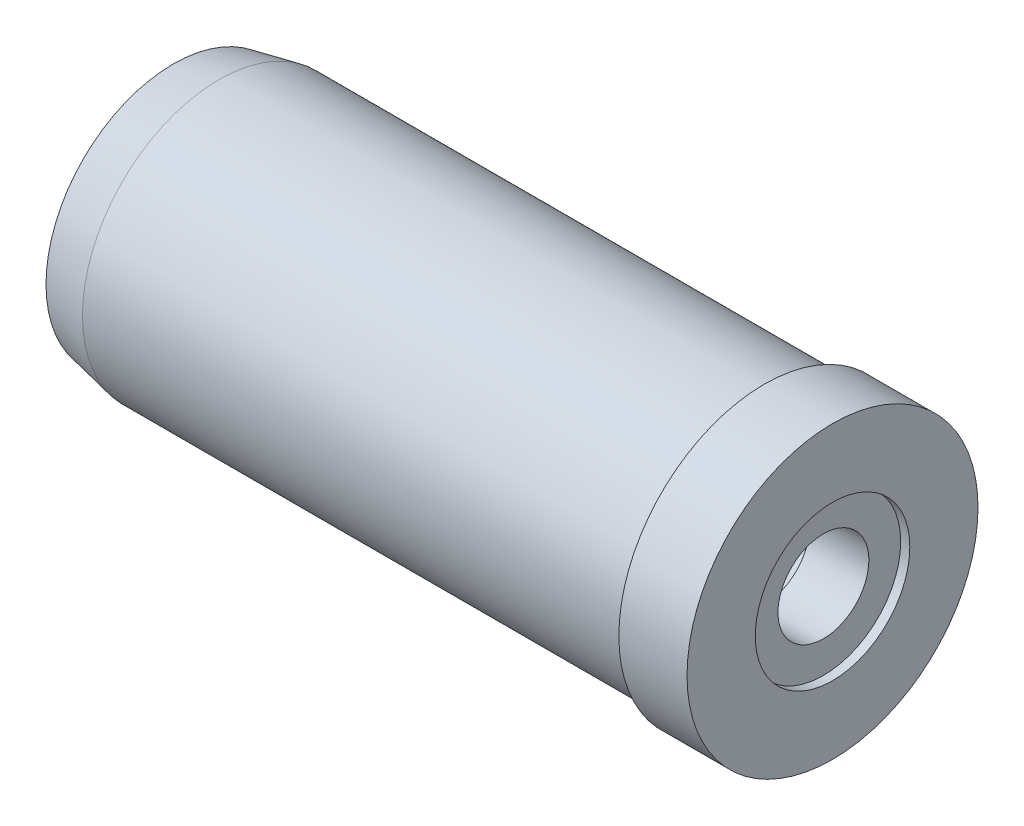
ISO-10303-21;
HEADER;
FILE_DESCRIPTION(('STEP AP214'),'2;1');
FILE_NAME('part.step','',(''),(''),'','','');
FILE_SCHEMA(('AUTOMOTIVE_DESIGN { 1 0 10303 214 1 1 1 1 }'));
ENDSEC;
DATA;
#1=APPLICATION_CONTEXT('core data for automotive mechanical design processes');
#2=APPLICATION_PROTOCOL_DEFINITION('international standard','automotive_design',2000,#1);
#3=PRODUCT_CONTEXT('',#1,'mechanical');
#4=PRODUCT('Part','Part','',(#3));
#5=PRODUCT_RELATED_PRODUCT_CATEGORY('part','',(#4));
#6=PRODUCT_DEFINITION_FORMATION('','',#4);
#7=PRODUCT_DEFINITION_CONTEXT('part definition',#1,'design');
#8=PRODUCT_DEFINITION('design','',#6,#7);
#9=PRODUCT_DEFINITION_SHAPE('','',#8);
#10=(LENGTH_UNIT() NAMED_UNIT(*) SI_UNIT(.MILLI.,.METRE.));
#11=(NAMED_UNIT(*) PLANE_ANGLE_UNIT() SI_UNIT($,.RADIAN.));
#12=(NAMED_UNIT(*) SI_UNIT($,.STERADIAN.) SOLID_ANGLE_UNIT());
#13=UNCERTAINTY_MEASURE_WITH_UNIT(LENGTH_MEASURE(1.E-05),#10,'distance_accuracy_value','');
#14=(GEOMETRIC_REPRESENTATION_CONTEXT(3) GLOBAL_UNCERTAINTY_ASSIGNED_CONTEXT((#13)) GLOBAL_UNIT_ASSIGNED_CONTEXT((#10,
#11,#12)) REPRESENTATION_CONTEXT('',''));
#15=CARTESIAN_POINT('',(0.,0.,0.));
#16=DIRECTION('',(0.,0.,1.));
#17=DIRECTION('',(1.,0.,0.));
#18=AXIS2_PLACEMENT_3D('',#15,#16,#17);
#19=CARTESIAN_POINT('',(32.5497741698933,0.,0.));
#20=DIRECTION('',(1.,0.,0.));
#21=DIRECTION('',(0.,0.,-1.));
#22=AXIS2_PLACEMENT_3D('',#19,#20,#21);
#23=CYLINDRICAL_SURFACE('',#22,10.);
#24=CARTESIAN_POINT('',(175.54977417,0.,0.));
#25=DIRECTION('',(1.,0.,0.));
#26=DIRECTION('',(0.,0.,-1.));
#27=AXIS2_PLACEMENT_3D('',#24,#25,#26);
#28=CIRCLE('',#27,10.);
#29=CARTESIAN_POINT('',(175.54977417,0.,-10.));
#30=VERTEX_POINT('',#29);
#31=EDGE_CURVE('E10',#30,#30,#28,.T.);
#32=ORIENTED_EDGE('',*,*,#31,.T.);
#33=EDGE_LOOP('',(#32));
#34=FACE_BOUND('',#33,.T.);
#35=CARTESIAN_POINT('',(162.54977417,0.,0.));
#36=DIRECTION('',(1.,0.,0.));
#37=DIRECTION('',(0.,0.,-1.));
#38=AXIS2_PLACEMENT_3D('',#35,#36,#37);
#39=CIRCLE('',#38,10.);
#40=CARTESIAN_POINT('',(162.54977417,0.,-10.));
#41=VERTEX_POINT('',#40);
#42=EDGE_CURVE('E76',#41,#41,#39,.T.);
#43=ORIENTED_EDGE('',*,*,#42,.F.);
#44=EDGE_LOOP('',(#43));
#45=FACE_BOUND('',#44,.T.);
#46=ADVANCED_FACE('F39',(#34,#45),#23,.F.);
#47=CARTESIAN_POINT('',(175.54977417,10.,0.));
#48=DIRECTION('',(1.,0.,0.));
#49=DIRECTION('',(0.,0.,-1.));
#50=AXIS2_PLACEMENT_3D('',#47,#48,#49);
#51=PLANE('',#50);
#52=CARTESIAN_POINT('',(175.54977417,0.,0.));
#53=DIRECTION('',(1.,0.,0.));
#54=DIRECTION('',(0.,0.,-1.));
#55=AXIS2_PLACEMENT_3D('',#52,#53,#54);
#56=CIRCLE('',#55,17.);
#57=CARTESIAN_POINT('',(175.54977417,0.,-17.));
#58=VERTEX_POINT('',#57);
#59=EDGE_CURVE('E45',#58,#58,#56,.T.);
#60=ORIENTED_EDGE('',*,*,#59,.T.);
#61=EDGE_LOOP('',(#60));
#62=FACE_BOUND('',#61,.T.);
#63=ORIENTED_EDGE('',*,*,#31,.F.);
#64=EDGE_LOOP('',(#63));
#65=FACE_BOUND('',#64,.T.);
#66=ADVANCED_FACE('F84',(#62,#65),#51,.T.);
#67=CARTESIAN_POINT('',(32.5497741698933,0.,0.));
#68=DIRECTION('',(1.,0.,0.));
#69=DIRECTION('',(0.,0.,-1.));
#70=AXIS2_PLACEMENT_3D('',#67,#68,#69);
#71=CYLINDRICAL_SURFACE('',#70,17.);
#72=CARTESIAN_POINT('',(177.54977417,0.,0.));
#73=DIRECTION('',(1.,0.,0.));
#74=DIRECTION('',(0.,0.,-1.));
#75=AXIS2_PLACEMENT_3D('',#72,#73,#74);
#76=CIRCLE('',#75,17.);
#77=CARTESIAN_POINT('',(177.54977417,0.,-17.));
#78=VERTEX_POINT('',#77);
#79=EDGE_CURVE('E49',#78,#78,#76,.T.);
#80=ORIENTED_EDGE('',*,*,#79,.T.);
#81=EDGE_LOOP('',(#80));
#82=FACE_BOUND('',#81,.T.);
#83=ORIENTED_EDGE('',*,*,#59,.F.);
#84=EDGE_LOOP('',(#83));
#85=FACE_BOUND('',#84,.T.);
#86=ADVANCED_FACE('F88',(#82,#85),#71,.F.);
#87=CARTESIAN_POINT('',(177.54977417,17.,0.));
#88=DIRECTION('',(1.,0.,0.));
#89=DIRECTION('',(0.,0.,-1.));
#90=AXIS2_PLACEMENT_3D('',#87,#88,#89);
#91=PLANE('',#90);
#92=CARTESIAN_POINT('',(177.54977417,0.,0.));
#93=DIRECTION('',(1.,0.,0.));
#94=DIRECTION('',(0.,0.,-1.));
#95=AXIS2_PLACEMENT_3D('',#92,#93,#94);
#96=CIRCLE('',#95,32.);
#97=CARTESIAN_POINT('',(177.54977417,0.,-32.));
#98=VERTEX_POINT('',#97);
#99=EDGE_CURVE('E53',#98,#98,#96,.T.);
#100=ORIENTED_EDGE('',*,*,#99,.T.);
#101=EDGE_LOOP('',(#100));
#102=FACE_BOUND('',#101,.T.);
#103=ORIENTED_EDGE('',*,*,#79,.F.);
#104=EDGE_LOOP('',(#103));
#105=FACE_BOUND('',#104,.T.);
#106=ADVANCED_FACE('F92',(#102,#105),#91,.T.);
#107=CARTESIAN_POINT('',(32.5497741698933,0.,0.));
#108=DIRECTION('',(1.,0.,0.));
#109=DIRECTION('',(0.,0.,-1.));
#110=AXIS2_PLACEMENT_3D('',#107,#108,#109);
#111=CYLINDRICAL_SURFACE('',#110,32.);
#112=CARTESIAN_POINT('',(162.549774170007,0.,0.));
#113=DIRECTION('',(1.,0.,0.));
#114=DIRECTION('',(0.,0.,-1.));
#115=AXIS2_PLACEMENT_3D('',#112,#113,#114);
#116=CIRCLE('',#115,32.);
#117=CARTESIAN_POINT('',(162.549774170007,0.,-32.));
#118=VERTEX_POINT('',#117);
#119=EDGE_CURVE('E58',#118,#118,#116,.T.);
#120=ORIENTED_EDGE('',*,*,#119,.T.);
#121=EDGE_LOOP('',(#120));
#122=FACE_BOUND('',#121,.T.);
#123=ORIENTED_EDGE('',*,*,#99,.F.);
#124=EDGE_LOOP('',(#123));
#125=FACE_BOUND('',#124,.T.);
#126=ADVANCED_FACE('F99',(#122,#125),#111,.T.);
#127=CARTESIAN_POINT('',(162.549774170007,32.,0.));
#128=DIRECTION('',(-1.,0.,0.));
#129=DIRECTION('',(0.,0.,1.));
#130=AXIS2_PLACEMENT_3D('',#127,#128,#129);
#131=PLANE('',#130);
#132=CARTESIAN_POINT('',(162.549774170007,0.,0.));
#133=DIRECTION('',(1.,0.,0.));
#134=DIRECTION('',(0.,0.,-1.));
#135=AXIS2_PLACEMENT_3D('',#132,#133,#134);
#136=CIRCLE('',#135,30.);
#137=CARTESIAN_POINT('',(162.549774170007,0.,-30.));
#138=VERTEX_POINT('',#137);
#139=EDGE_CURVE('E61',#138,#138,#136,.T.);
#140=ORIENTED_EDGE('',*,*,#139,.T.);
#141=EDGE_LOOP('',(#140));
#142=FACE_BOUND('',#141,.T.);
#143=ORIENTED_EDGE('',*,*,#119,.F.);
#144=EDGE_LOOP('',(#143));
#145=FACE_BOUND('',#144,.T.);
#146=ADVANCED_FACE('F103',(#142,#145),#131,.T.);
#147=CARTESIAN_POINT('',(32.5497741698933,0.,0.));
#148=DIRECTION('',(1.,0.,0.));
#149=DIRECTION('',(0.,0.,-1.));
#150=AXIS2_PLACEMENT_3D('',#147,#148,#149);
#151=CYLINDRICAL_SURFACE('',#150,30.);
#152=CARTESIAN_POINT('',(42.5664419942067,0.,0.));
#153=DIRECTION('',(1.,0.,0.));
#154=DIRECTION('',(0.,0.,-1.));
#155=AXIS2_PLACEMENT_3D('',#152,#153,#154);
#156=CIRCLE('',#155,30.);
#157=CARTESIAN_POINT('',(42.5664419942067,0.,-30.));
#158=VERTEX_POINT('',#157);
#159=EDGE_CURVE('E64',#158,#158,#156,.T.);
#160=ORIENTED_EDGE('',*,*,#159,.T.);
#161=EDGE_LOOP('',(#160));
#162=FACE_BOUND('',#161,.T.);
#163=ORIENTED_EDGE('',*,*,#139,.F.);
#164=EDGE_LOOP('',(#163));
#165=FACE_BOUND('',#164,.T.);
#166=ADVANCED_FACE('F107',(#162,#165),#151,.T.);
#167=CARTESIAN_POINT('',(42.5664419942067,0.,0.));
#168=DIRECTION('',(1.,0.,0.));
#169=DIRECTION('',(0.,0.,-1.));
#170=AXIS2_PLACEMENT_3D('',#167,#168,#169);
#171=CONICAL_SURFACE('',#170,30.,0.197075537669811);
#172=CARTESIAN_POINT('',(32.5497741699,0.,0.));
#173=DIRECTION('',(1.,0.,0.));
#174=DIRECTION('',(0.,0.,-1.));
#175=AXIS2_PLACEMENT_3D('',#172,#173,#174);
#176=CIRCLE('',#175,27.9999999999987);
#177=CARTESIAN_POINT('',(32.5497741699,0.,-27.9999999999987));
#178=VERTEX_POINT('',#177);
#179=EDGE_CURVE('E67',#178,#178,#176,.T.);
#180=ORIENTED_EDGE('',*,*,#179,.T.);
#181=EDGE_LOOP('',(#180));
#182=FACE_BOUND('',#181,.T.);
#183=ORIENTED_EDGE('',*,*,#159,.F.);
#184=EDGE_LOOP('',(#183));
#185=FACE_BOUND('',#184,.T.);
#186=ADVANCED_FACE('F111',(#182,#185),#171,.T.);
#187=CARTESIAN_POINT('',(32.5497741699,27.9999999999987,0.));
#188=DIRECTION('',(-1.,0.,0.));
#189=DIRECTION('',(0.,0.,1.));
#190=AXIS2_PLACEMENT_3D('',#187,#188,#189);
#191=PLANE('',#190);
#192=CARTESIAN_POINT('',(32.5497741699,0.,0.));
#193=DIRECTION('',(1.,0.,0.));
#194=DIRECTION('',(0.,0.,-1.));
#195=AXIS2_PLACEMENT_3D('',#192,#193,#194);
#196=CIRCLE('',#195,24.);
#197=CARTESIAN_POINT('',(32.5497741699,0.,-24.));
#198=VERTEX_POINT('',#197);
#199=EDGE_CURVE('E70',#198,#198,#196,.T.);
#200=ORIENTED_EDGE('',*,*,#199,.T.);
#201=EDGE_LOOP('',(#200));
#202=FACE_BOUND('',#201,.T.);
#203=ORIENTED_EDGE('',*,*,#179,.F.);
#204=EDGE_LOOP('',(#203));
#205=FACE_BOUND('',#204,.T.);
#206=ADVANCED_FACE('F115',(#202,#205),#191,.T.);
#207=CARTESIAN_POINT('',(32.5497741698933,0.,0.));
#208=DIRECTION('',(1.,0.,0.));
#209=DIRECTION('',(0.,0.,-1.));
#210=AXIS2_PLACEMENT_3D('',#207,#208,#209);
#211=CYLINDRICAL_SURFACE('',#210,24.);
#212=CARTESIAN_POINT('',(162.54977417,0.,0.));
#213=DIRECTION('',(1.,0.,0.));
#214=DIRECTION('',(0.,0.,-1.));
#215=AXIS2_PLACEMENT_3D('',#212,#213,#214);
#216=CIRCLE('',#215,24.);
#217=CARTESIAN_POINT('',(162.54977417,0.,-24.));
#218=VERTEX_POINT('',#217);
#219=EDGE_CURVE('E73',#218,#218,#216,.T.);
#220=ORIENTED_EDGE('',*,*,#219,.T.);
#221=EDGE_LOOP('',(#220));
#222=FACE_BOUND('',#221,.T.);
#223=ORIENTED_EDGE('',*,*,#199,.F.);
#224=EDGE_LOOP('',(#223));
#225=FACE_BOUND('',#224,.T.);
#226=ADVANCED_FACE('F119',(#222,#225),#211,.F.);
#227=CARTESIAN_POINT('',(162.54977417,24.,0.));
#228=DIRECTION('',(-1.,0.,0.));
#229=DIRECTION('',(0.,0.,1.));
#230=AXIS2_PLACEMENT_3D('',#227,#228,#229);
#231=PLANE('',#230);
#232=ORIENTED_EDGE('',*,*,#42,.T.);
#233=EDGE_LOOP('',(#232));
#234=FACE_BOUND('',#233,.T.);
#235=ORIENTED_EDGE('',*,*,#219,.F.);
#236=EDGE_LOOP('',(#235));
#237=FACE_BOUND('',#236,.T.);
#238=ADVANCED_FACE('F80',(#234,#237),#231,.T.);
#239=CLOSED_SHELL('',(#46,#66,#86,#106,#126,#146,#166,#186,#206,#226,#238));
#240=MANIFOLD_SOLID_BREP('B2',#239);
#241=ADVANCED_BREP_SHAPE_REPRESENTATION('',(#18,#240),#14);
#242=SHAPE_DEFINITION_REPRESENTATION(#9,#241);
ENDSEC;
END-ISO-10303-21;
